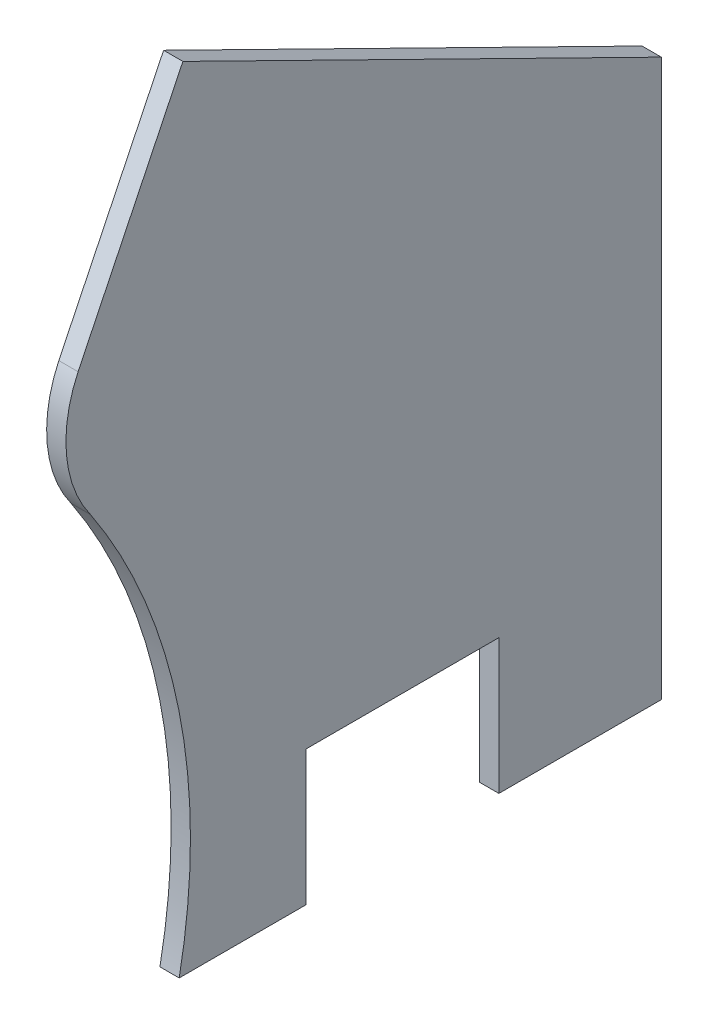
from build123d import *

# Parameters (mm, degrees)
BOSS_EXTRU_1_DEPTH      = 10
ESQUISSE5_R             = 66.434100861
ENL_V_MAT_EXTRU_2_DEPTH = 10


with BuildPart() as part:
    # Esquisse2 → Boss.-Extru.1 (new body)
    with BuildSketch(Plane(origin=(0, 0, 0), x_dir=(0, 0, -1), z_dir=(1, 0, 0))):
        with BuildLine():
            Line((62.11144606, -17.556283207), (7.755938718, -129.765163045))
            ThreePointArc((7.755938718, -129.765163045), (1.741585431, -164.32619549), (14.173197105, -197.13004344))
            ThreePointArc((14.173197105, -197.13004344), (60.076731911, -308.168781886), (60.20149461, -428.321686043))
            Line((60.20149461, -428.321686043), (125.9766866, -428.321686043))
            Line((125.9766866, -428.321686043), (125.9766866, -358.341686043))
            Line((125.9766866, -358.341686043), (225.9966866, -358.341686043))
            Line((225.9966866, -358.341686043), (225.9966866, -428.321686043))
            Line((225.9966866, -428.321686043), (310.28364072, -428.321686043))
            Line((310.28364072, -428.321686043), (310.28364072, -139.724382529))
            Line((310.28364072, -139.724382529), (62.11144606, -17.556283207))
        make_face()
    extrude(amount=BOSS_EXTRU_1_DEPTH)

    # Esquisse5 → Enl_v. mat.-Extru.2 (cut)
    with BuildSketch(Plane.ZY):
        with Locations((-961.779859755, -372.095858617)):
            Circle(ESQUISSE5_R)
    extrude(amount=-ENL_V_MAT_EXTRU_2_DEPTH, mode=Mode.SUBTRACT)


solid = part.part
